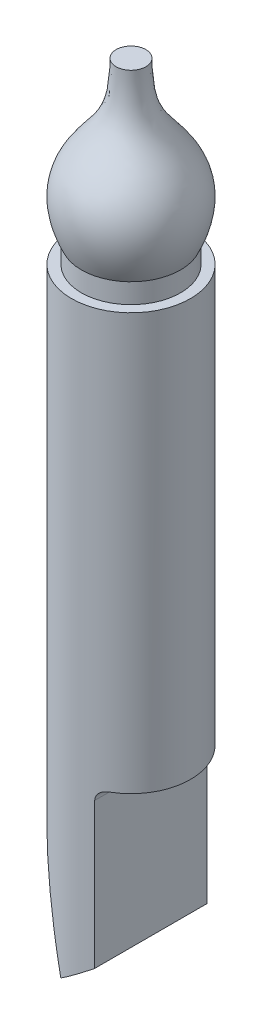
ISO-10303-21;
HEADER;
FILE_DESCRIPTION(('STEP AP214'),'2;1');
FILE_NAME('part.step','',(''),(''),'','','');
FILE_SCHEMA(('AUTOMOTIVE_DESIGN { 1 0 10303 214 1 1 1 1 }'));
ENDSEC;
DATA;
#1=APPLICATION_CONTEXT('core data for automotive mechanical design processes');
#2=APPLICATION_PROTOCOL_DEFINITION('international standard','automotive_design',2000,#1);
#3=PRODUCT_CONTEXT('',#1,'mechanical');
#4=PRODUCT('Part','Part','',(#3));
#5=PRODUCT_RELATED_PRODUCT_CATEGORY('part','',(#4));
#6=PRODUCT_DEFINITION_FORMATION('','',#4);
#7=PRODUCT_DEFINITION_CONTEXT('part definition',#1,'design');
#8=PRODUCT_DEFINITION('design','',#6,#7);
#9=PRODUCT_DEFINITION_SHAPE('','',#8);
#10=(LENGTH_UNIT() NAMED_UNIT(*) SI_UNIT(.MILLI.,.METRE.));
#11=(NAMED_UNIT(*) PLANE_ANGLE_UNIT() SI_UNIT($,.RADIAN.));
#12=(NAMED_UNIT(*) SI_UNIT($,.STERADIAN.) SOLID_ANGLE_UNIT());
#13=UNCERTAINTY_MEASURE_WITH_UNIT(LENGTH_MEASURE(1.E-05),#10,'distance_accuracy_value','');
#14=(GEOMETRIC_REPRESENTATION_CONTEXT(3) GLOBAL_UNCERTAINTY_ASSIGNED_CONTEXT((#13)) GLOBAL_UNIT_ASSIGNED_CONTEXT((#10,
#11,#12)) REPRESENTATION_CONTEXT('',''));
#15=CARTESIAN_POINT('',(0.,0.,0.));
#16=DIRECTION('',(0.,0.,1.));
#17=DIRECTION('',(1.,0.,0.));
#18=AXIS2_PLACEMENT_3D('',#15,#16,#17);
#19=CARTESIAN_POINT('',(0.75,39.,0.));
#20=DIRECTION('',(0.,-1.,0.));
#21=DIRECTION('',(0.,0.,-1.));
#22=AXIS2_PLACEMENT_3D('',#19,#20,#21);
#23=PLANE('',#22);
#24=CARTESIAN_POINT('',(0.,39.,0.));
#25=DIRECTION('',(0.,1.,0.));
#26=DIRECTION('',(0.,0.,1.));
#27=AXIS2_PLACEMENT_3D('',#24,#25,#26);
#28=CIRCLE('',#27,0.75);
#29=CARTESIAN_POINT('',(0.,39.,0.75));
#30=VERTEX_POINT('',#29);
#31=EDGE_CURVE('E148',#30,#30,#28,.T.);
#32=ORIENTED_EDGE('',*,*,#31,.T.);
#33=EDGE_LOOP('',(#32));
#34=FACE_BOUND('',#33,.T.);
#35=ADVANCED_FACE('F30',(#34),#23,.F.);
#36=CARTESIAN_POINT('',(2.49999999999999,31.,0.));
#37=CARTESIAN_POINT('',(3.62216646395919,33.3621251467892,0.));
#38=CARTESIAN_POINT('',(1.62304376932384,35.871683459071,0.));
#39=CARTESIAN_POINT('',(0.75,36.9949117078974,0.));
#40=CARTESIAN_POINT('',(0.75,39.,0.));
#41=B_SPLINE_CURVE_WITH_KNOTS('',3,(#36,#37,#38,#39,#40),.UNSPECIFIED.,.F.,.F.,(4,1,4),(0.,
0.508286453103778,1.),.UNSPECIFIED.);
#42=CARTESIAN_POINT('',(0.,39.,0.));
#43=DIRECTION('',(0.,1.,0.));
#44=AXIS1_PLACEMENT('',#42,#43);
#45=SURFACE_OF_REVOLUTION('',#41,#44);
#46=ORIENTED_EDGE('',*,*,#31,.F.);
#47=EDGE_LOOP('',(#46));
#48=FACE_BOUND('',#47,.T.);
#49=CARTESIAN_POINT('',(0.,31.,0.));
#50=DIRECTION('',(0.,1.,0.));
#51=DIRECTION('',(0.,0.,1.));
#52=AXIS2_PLACEMENT_3D('',#49,#50,#51);
#53=CIRCLE('',#52,2.5);
#54=CARTESIAN_POINT('',(0.,31.,2.5));
#55=VERTEX_POINT('',#54);
#56=EDGE_CURVE('E150',#55,#55,#53,.T.);
#57=ORIENTED_EDGE('',*,*,#56,.T.);
#58=EDGE_LOOP('',(#57));
#59=FACE_BOUND('',#58,.T.);
#60=ADVANCED_FACE('F101',(#48,#59),#45,.T.);
#61=CARTESIAN_POINT('',(0.,39.,0.));
#62=DIRECTION('',(0.,1.,0.));
#63=DIRECTION('',(0.,0.,1.));
#64=AXIS2_PLACEMENT_3D('',#61,#62,#63);
#65=CYLINDRICAL_SURFACE('',#64,2.5);
#66=ORIENTED_EDGE('',*,*,#56,.F.);
#67=EDGE_LOOP('',(#66));
#68=FACE_BOUND('',#67,.T.);
#69=CARTESIAN_POINT('',(0.,30.,0.));
#70=DIRECTION('',(0.,1.,0.));
#71=DIRECTION('',(0.,0.,1.));
#72=AXIS2_PLACEMENT_3D('',#69,#70,#71);
#73=CIRCLE('',#72,2.5);
#74=CARTESIAN_POINT('',(0.,30.,2.5));
#75=VERTEX_POINT('',#74);
#76=EDGE_CURVE('E154',#75,#75,#73,.T.);
#77=ORIENTED_EDGE('',*,*,#76,.T.);
#78=EDGE_LOOP('',(#77));
#79=FACE_BOUND('',#78,.T.);
#80=ADVANCED_FACE('F104',(#68,#79),#65,.T.);
#81=CARTESIAN_POINT('',(3.,30.,0.));
#82=DIRECTION('',(0.,-1.,0.));
#83=DIRECTION('',(0.,0.,-1.));
#84=AXIS2_PLACEMENT_3D('',#81,#82,#83);
#85=PLANE('',#84);
#86=ORIENTED_EDGE('',*,*,#76,.F.);
#87=EDGE_LOOP('',(#86));
#88=FACE_BOUND('',#87,.T.);
#89=CARTESIAN_POINT('',(0.,30.,0.));
#90=DIRECTION('',(0.,1.,0.));
#91=DIRECTION('',(0.,0.,1.));
#92=AXIS2_PLACEMENT_3D('',#89,#90,#91);
#93=CIRCLE('',#92,3.);
#94=CARTESIAN_POINT('',(0.,30.,3.));
#95=VERTEX_POINT('',#94);
#96=EDGE_CURVE('E91',#95,#95,#93,.T.);
#97=ORIENTED_EDGE('',*,*,#96,.T.);
#98=EDGE_LOOP('',(#97));
#99=FACE_BOUND('',#98,.T.);
#100=ADVANCED_FACE('F108',(#88,#99),#85,.F.);
#101=CARTESIAN_POINT('',(0.,39.,0.));
#102=DIRECTION('',(0.,1.,0.));
#103=DIRECTION('',(0.,0.,1.));
#104=AXIS2_PLACEMENT_3D('',#101,#102,#103);
#105=CYLINDRICAL_SURFACE('',#104,3.);
#106=ORIENTED_EDGE('',*,*,#96,.F.);
#107=EDGE_LOOP('',(#106));
#108=FACE_BOUND('',#107,.T.);
#109=CARTESIAN_POINT('',(1.5,9.,2.59807621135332));
#110=CARTESIAN_POINT('',(1.47085581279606,9.00002034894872,2.61492921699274));
#111=CARTESIAN_POINT('',(1.44135552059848,8.99744963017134,2.63128095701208));
#112=CARTESIAN_POINT('',(1.38245236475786,8.98690615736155,2.66268813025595));
#113=CARTESIAN_POINT('',(1.35305067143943,8.97890720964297,2.67773687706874));
#114=CARTESIAN_POINT('',(1.29534589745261,8.95724183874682,2.70612750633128));
#115=CARTESIAN_POINT('',(1.26704745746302,8.94355381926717,2.71946262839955));
#116=CARTESIAN_POINT('',(1.21295025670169,8.91061105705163,2.74401715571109));
#117=CARTESIAN_POINT('',(1.18714561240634,8.89136986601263,2.75524160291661));
#118=CARTESIAN_POINT('',(1.14168067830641,8.84993732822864,2.77436726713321));
#119=CARTESIAN_POINT('',(1.12166308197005,8.82823993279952,2.78248958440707));
#120=CARTESIAN_POINT('',(1.08552425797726,8.78122547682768,2.79678671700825));
#121=CARTESIAN_POINT('',(1.06940384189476,8.75590766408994,2.80296112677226));
#122=CARTESIAN_POINT('',(1.04300335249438,8.7047278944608,2.812885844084));
#123=CARTESIAN_POINT('',(1.03234653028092,8.67909014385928,2.81679616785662));
#124=CARTESIAN_POINT('',(1.01540694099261,8.6262400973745,2.82294724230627));
#125=CARTESIAN_POINT('',(1.00911724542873,8.59903037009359,2.82519063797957));
#126=CARTESIAN_POINT('',(1.00342529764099,8.55964418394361,2.82721420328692));
#127=CARTESIAN_POINT('',(1.00214084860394,8.54774613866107,2.82766949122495));
#128=CARTESIAN_POINT('',(1.0004290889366,8.5239007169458,2.82827549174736));
#129=CARTESIAN_POINT('',(1.00000035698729,8.51195345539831,2.82842670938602));
#130=CARTESIAN_POINT('',(1.,8.5,2.82842712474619));
#131=B_SPLINE_CURVE_WITH_KNOTS('',3,(#109,#110,#111,#112,#113,#114,#115,#116,#117,#118,#119,
#120,#121,#122,#123,#124,#125,#126,#127,#128,#129,#130),.UNSPECIFIED.,.F.,.F.,(4,2,2,2,2,2,2,2,
2,2,4),(0.,0.100983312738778,0.202457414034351,0.304320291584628,0.405936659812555,
0.497294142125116,0.588670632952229,0.672374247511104,0.755944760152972,0.791843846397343,
0.827683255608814),.UNSPECIFIED.);
#132=CARTESIAN_POINT('',(1.5,9.,2.59807621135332));
#133=VERTEX_POINT('',#132);
#134=CARTESIAN_POINT('',(1.,8.5,2.82842712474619));
#135=VERTEX_POINT('',#134);
#136=EDGE_CURVE('E44',#133,#135,#131,.T.);
#137=ORIENTED_EDGE('',*,*,#136,.F.);
#138=CARTESIAN_POINT('',(0.,9.,0.));
#139=DIRECTION('',(0.,1.,0.));
#140=DIRECTION('',(0.,0.,1.));
#141=AXIS2_PLACEMENT_3D('',#138,#139,#140);
#142=CIRCLE('',#141,3.);
#143=CARTESIAN_POINT('',(1.5,9.,-2.59807621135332));
#144=VERTEX_POINT('',#143);
#145=EDGE_CURVE('E11',#133,#144,#142,.T.);
#146=ORIENTED_EDGE('',*,*,#145,.T.);
#147=CARTESIAN_POINT('',(1.,8.5,-2.82842712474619));
#148=CARTESIAN_POINT('',(0.999970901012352,8.52678489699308,-2.82842652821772));
#149=CARTESIAN_POINT('',(1.00215041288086,8.5535578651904,-2.82766670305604));
#150=CARTESIAN_POINT('',(1.01070731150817,8.60628630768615,-2.82462519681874));
#151=CARTESIAN_POINT('',(1.01707692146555,8.63224320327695,-2.82234633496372));
#152=CARTESIAN_POINT('',(1.03379772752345,8.68265530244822,-2.81626281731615));
#153=CARTESIAN_POINT('',(1.04414967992,8.70711021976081,-2.81245787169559));
#154=CARTESIAN_POINT('',(1.06843424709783,8.75385909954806,-2.80332249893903));
#155=CARTESIAN_POINT('',(1.08236721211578,8.77615285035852,-2.79799192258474));
#156=CARTESIAN_POINT('',(1.11353532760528,8.81834477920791,-2.78573551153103));
#157=CARTESIAN_POINT('',(1.13081691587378,8.83820196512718,-2.77878692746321));
#158=CARTESIAN_POINT('',(1.16791543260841,8.87469612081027,-2.76339942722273));
#159=CARTESIAN_POINT('',(1.187732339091,8.89133311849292,-2.75496052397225));
#160=CARTESIAN_POINT('',(1.23029163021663,8.92187383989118,-2.73622889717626));
#161=CARTESIAN_POINT('',(1.25313110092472,8.93559764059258,-2.72586419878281));
#162=CARTESIAN_POINT('',(1.30016274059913,8.9590830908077,-2.70374817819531));
#163=CARTESIAN_POINT('',(1.3243564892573,8.96883999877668,-2.69199521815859));
#164=CARTESIAN_POINT('',(1.37381755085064,8.98452314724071,-2.66709583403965));
#165=CARTESIAN_POINT('',(1.39909621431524,8.99037986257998,-2.65392874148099));
#166=CARTESIAN_POINT('',(1.4496663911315,8.99811760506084,-2.62665375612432));
#167=CARTESIAN_POINT('',(1.474957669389,9.00000974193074,-2.61254860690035));
#168=CARTESIAN_POINT('',(1.5,9.,-2.59807621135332));
#169=B_SPLINE_CURVE_WITH_KNOTS('',3,(#147,#148,#149,#150,#151,#152,#153,#154,#155,#156,#157,
#158,#159,#160,#161,#162,#163,#164,#165,#166,#167,#168),.UNSPECIFIED.,.F.,.F.,(4,2,2,2,2,2,2,2,
2,2,4),(0.,0.0802373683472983,0.160326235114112,0.240430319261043,0.320542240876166,
0.401856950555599,0.483170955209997,0.56858144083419,0.654093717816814,0.741092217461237,
0.82784659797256),.UNSPECIFIED.);
#170=CARTESIAN_POINT('',(1.,8.5,-2.82842712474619));
#171=VERTEX_POINT('',#170);
#172=EDGE_CURVE('E37',#171,#144,#169,.T.);
#173=ORIENTED_EDGE('',*,*,#172,.F.);
#174=DIRECTION('',(0.,1.,0.));
#175=VECTOR('',#174,1.);
#176=CARTESIAN_POINT('',(1.,39.,-2.82842712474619));
#177=LINE('',#176,#175);
#178=CARTESIAN_POINT('',(1.,1.16246804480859,-2.82842712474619));
#179=VERTEX_POINT('',#178);
#180=EDGE_CURVE('E51',#179,#171,#177,.T.);
#181=ORIENTED_EDGE('',*,*,#180,.F.);
#182=CARTESIAN_POINT('',(0.,0.435925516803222,0.));
#183=DIRECTION('',(0.587785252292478,-0.809016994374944,0.));
#184=DIRECTION('',(0.809016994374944,0.587785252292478,0.));
#185=AXIS2_PLACEMENT_3D('',#182,#183,#184);
#186=ELLIPSE('',#185,3.70820393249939,3.);
#187=CARTESIAN_POINT('',(-0.6,0.,-2.93938769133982));
#188=VERTEX_POINT('',#187);
#189=EDGE_CURVE('E79',#188,#179,#186,.T.);
#190=ORIENTED_EDGE('',*,*,#189,.F.);
#191=CARTESIAN_POINT('',(0.,-2.2392304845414,0.));
#192=DIRECTION('',(0.96592582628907,0.258819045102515,0.));
#193=DIRECTION('',(-0.258819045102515,0.96592582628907,0.));
#194=AXIS2_PLACEMENT_3D('',#191,#192,#193);
#195=ELLIPSE('',#194,11.5911099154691,3.);
#196=CARTESIAN_POINT('',(-0.6,0.,2.93938769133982));
#197=VERTEX_POINT('',#196);
#198=EDGE_CURVE('E71',#188,#197,#195,.T.);
#199=ORIENTED_EDGE('',*,*,#198,.T.);
#200=CARTESIAN_POINT('',(1.,1.16246804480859,2.82842712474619));
#201=VERTEX_POINT('',#200);
#202=EDGE_CURVE('E85',#201,#197,#186,.T.);
#203=ORIENTED_EDGE('',*,*,#202,.F.);
#204=DIRECTION('',(0.,1.,0.));
#205=VECTOR('',#204,1.);
#206=CARTESIAN_POINT('',(1.,39.,2.82842712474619));
#207=LINE('',#206,#205);
#208=EDGE_CURVE('E149',#135,#201,#207,.F.);
#209=ORIENTED_EDGE('',*,*,#208,.F.);
#210=EDGE_LOOP('',(#137,#146,#173,#181,#190,#199,#203,#209));
#211=FACE_BOUND('',#210,.T.);
#212=ADVANCED_FACE('F88',(#108,#211),#105,.T.);
#213=CARTESIAN_POINT('',(1.,-6.45939305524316,-3.62216646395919));
#214=DIRECTION('',(1.,0.,0.));
#215=DIRECTION('',(0.,0.,-1.));
#216=AXIS2_PLACEMENT_3D('',#213,#214,#215);
#217=PLANE('',#216);
#218=ORIENTED_EDGE('',*,*,#180,.T.);
#219=DIRECTION('',(0.,0.,1.));
#220=VECTOR('',#219,1.);
#221=CARTESIAN_POINT('',(1.,8.5,-3.62216646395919));
#222=LINE('',#221,#220);
#223=EDGE_CURVE('E165',#171,#135,#222,.T.);
#224=ORIENTED_EDGE('',*,*,#223,.T.);
#225=ORIENTED_EDGE('',*,*,#208,.T.);
#226=DIRECTION('',(0.,0.,1.));
#227=VECTOR('',#226,1.);
#228=CARTESIAN_POINT('',(1.,1.16246804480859,-3.62216646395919));
#229=LINE('',#228,#227);
#230=EDGE_CURVE('E80',#179,#201,#229,.T.);
#231=ORIENTED_EDGE('',*,*,#230,.F.);
#232=EDGE_LOOP('',(#218,#224,#225,#231));
#233=FACE_BOUND('',#232,.T.);
#234=ADVANCED_FACE('F116',(#233),#217,.T.);
#235=CARTESIAN_POINT('',(1.5,8.5,-3.62216646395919));
#236=DIRECTION('',(0.,0.,1.));
#237=DIRECTION('',(1.,0.,0.));
#238=AXIS2_PLACEMENT_3D('',#235,#236,#237);
#239=CYLINDRICAL_SURFACE('',#238,0.5);
#240=ORIENTED_EDGE('',*,*,#172,.T.);
#241=DIRECTION('',(0.,0.,1.));
#242=VECTOR('',#241,1.);
#243=CARTESIAN_POINT('',(1.5,9.,-3.62216646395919));
#244=LINE('',#243,#242);
#245=EDGE_CURVE('E86',#144,#133,#244,.T.);
#246=ORIENTED_EDGE('',*,*,#245,.T.);
#247=ORIENTED_EDGE('',*,*,#136,.T.);
#248=ORIENTED_EDGE('',*,*,#223,.F.);
#249=EDGE_LOOP('',(#240,#246,#247,#248));
#250=FACE_BOUND('',#249,.T.);
#251=ADVANCED_FACE('F129',(#250),#239,.F.);
#252=CARTESIAN_POINT('',(-0.0881486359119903,9.,-3.62216646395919));
#253=DIRECTION('',(0.,1.,0.));
#254=DIRECTION('',(0.,0.,1.));
#255=AXIS2_PLACEMENT_3D('',#252,#253,#254);
#256=PLANE('',#255);
#257=ORIENTED_EDGE('',*,*,#245,.F.);
#258=ORIENTED_EDGE('',*,*,#145,.F.);
#259=EDGE_LOOP('',(#257,#258));
#260=FACE_BOUND('',#259,.T.);
#261=ADVANCED_FACE('F134',(#260),#256,.F.);
#262=CARTESIAN_POINT('',(-3.33661286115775,-1.98826562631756,-3.62216646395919));
#263=DIRECTION('',(0.587785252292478,-0.809016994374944,0.));
#264=DIRECTION('',(0.809016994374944,0.587785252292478,0.));
#265=AXIS2_PLACEMENT_3D('',#262,#263,#264);
#266=PLANE('',#265);
#267=ORIENTED_EDGE('',*,*,#202,.T.);
#268=DIRECTION('',(0.,0.,1.));
#269=VECTOR('',#268,1.);
#270=CARTESIAN_POINT('',(-0.6,0.,-3.62216646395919));
#271=LINE('',#270,#269);
#272=EDGE_CURVE('E74',#188,#197,#271,.T.);
#273=ORIENTED_EDGE('',*,*,#272,.F.);
#274=ORIENTED_EDGE('',*,*,#189,.T.);
#275=ORIENTED_EDGE('',*,*,#230,.T.);
#276=EDGE_LOOP('',(#267,#273,#274,#275));
#277=FACE_BOUND('',#276,.T.);
#278=ADVANCED_FACE('F83',(#277),#266,.T.);
#279=CARTESIAN_POINT('',(1.04913580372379,-6.15465860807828,-3.62216646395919));
#280=DIRECTION('',(0.96592582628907,0.258819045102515,0.));
#281=DIRECTION('',(-0.258819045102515,0.96592582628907,0.));
#282=AXIS2_PLACEMENT_3D('',#279,#280,#281);
#283=PLANE('',#282);
#284=ORIENTED_EDGE('',*,*,#198,.F.);
#285=ORIENTED_EDGE('',*,*,#272,.T.);
#286=EDGE_LOOP('',(#284,#285));
#287=FACE_BOUND('',#286,.T.);
#288=ADVANCED_FACE('F73',(#287),#283,.F.);
#289=CLOSED_SHELL('',(#35,#60,#80,#100,#212,#234,#251,#261,#278,#288));
#290=MANIFOLD_SOLID_BREP('B2',#289);
#291=ADVANCED_BREP_SHAPE_REPRESENTATION('',(#18,#290),#14);
#292=SHAPE_DEFINITION_REPRESENTATION(#9,#291);
ENDSEC;
END-ISO-10303-21;
